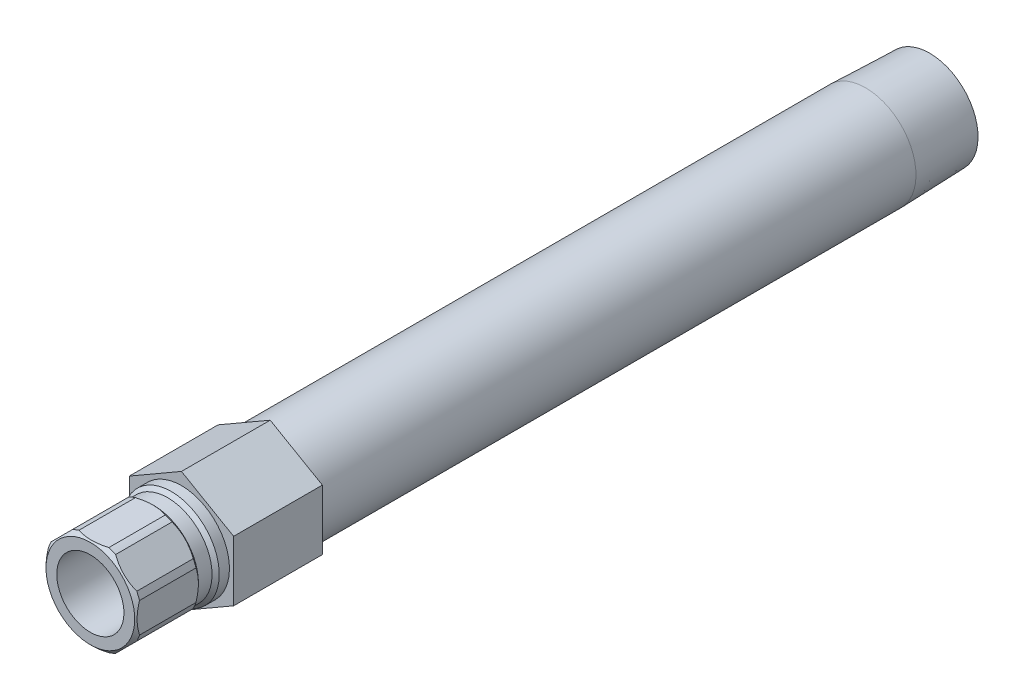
from build123d import *

# Parameters (mm, degrees)
SKETCH2_R           = 7.112
BOSS_EXTRUDE1_DEPTH = 18.796
CUT_EXTRUDE1_START  = 5.8166
SKETCH3_OUTSIDE_W   = 60.294
SKETCH3_OUTSIDE_H   = 63.712
CUT_EXTRUDE1_DEPTH  = 154.575483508


with BuildPart() as part:
    # Sketch1 → Revolve1 (revolve)
    with BuildSketch(Plane(origin=(0, 0, 0), x_dir=(0, 0, -1), z_dir=(1, 0, 0))):
        Polygon((-19.304, 7.112), (-19.304, 9.398), (-18.542, 10.16), (-6.5786, 10.16), (-5.8166, 9.398), (-2.921, 9.398), (-2.159, 10.16), (0, 10.16), (0, 10.668), (144.9324, 10.668), (158.496, 10.244140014), (158.496, 7.8994), (-1.105331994, 7.8994), (-1.524, 7.112), align=None)
    revolve(axis=Axis((0, 0, 0), (0, 0, 1)))

    # Sketch2 → Boss-Extrude1 (add)
    with BuildSketch(Plane.XY):
        Polygon((-11.049, 6.379143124), (-11.049, -6.379143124), (0, -12.758286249), (11.049, -6.379143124), (11.049, 6.379143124), (0, 12.758286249), align=None)
        with Locations(Location((0, 0, 0), (0, 0, 90))):
            Circle(SKETCH2_R, mode=Mode.SUBTRACT)
    extrude(amount=-BOSS_EXTRUDE1_DEPTH)

    # Sketch3 outside → Cut-Extrude1 (cut, through all)
    with BuildSketch(Plane.XY.offset(CUT_EXTRUDE1_START)):
        Rectangle(SKETCH3_OUTSIDE_W, SKETCH3_OUTSIDE_H)
        Polygon((9.652, -3.997989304), (9.652, 3.997989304), (3.997989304, 9.652), (-3.997989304, 9.652), (-9.652, 3.997989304), (-9.652, -3.997989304), (-3.997989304, -9.652), (3.997989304, -9.652), align=None, mode=Mode.SUBTRACT)
    extrude(amount=CUT_EXTRUDE1_DEPTH, mode=Mode.SUBTRACT)


solid = part.part
